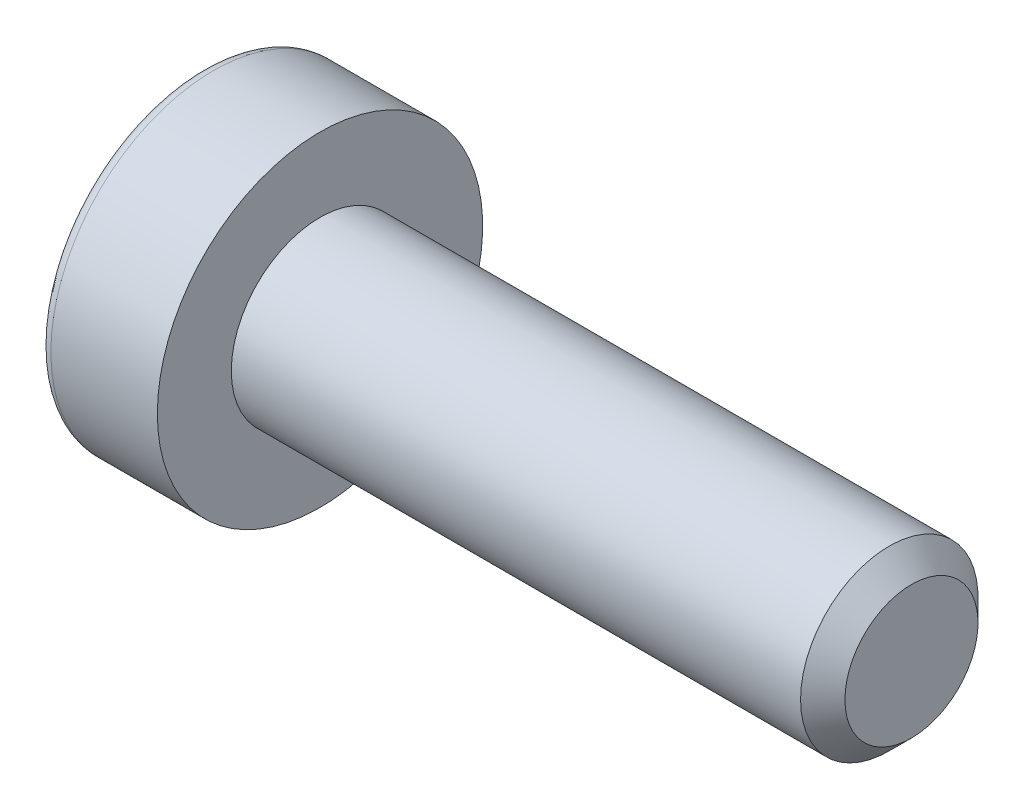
from build123d import *

# Parameters (mm, degrees)
CHANFREIN1_SIZE         = 0.375
ENL_V_MAT_EXTRU_1_DEPTH = 1
CONG_1_R                = 0.2


with BuildPart() as part:
    # Esquisse1 → R_volution1 (revolve)
    with BuildSketch(Plane.XY, mode=Mode.PRIVATE) as r_volution1_sk:
        Polygon((12, 0), (12, 1.5), (2, 1.5), (2, 2.75), (0, 2.75), (0, 0), align=None)
    revolve(r_volution1_sk.sketch.rotate(Axis((0, 0, 0), (1, 0, 0)), 90), axis=Axis((0, 0, 0), (1, 0, 0)))

    # Chanfrein1
    chanfrein1_edges = [part.edges().sort_by_distance(p)[0] for p in [
        (12, 0, -1.5),
    ]]
    chamfer(chanfrein1_edges, length=CHANFREIN1_SIZE)

    # Esquisse2 → R_volution2 (revolve)
    with BuildSketch(Plane.XY, mode=Mode.PRIVATE) as r_volution2_sk:
        Polygon((0, 0), (0, 1.25), (1, 1.25), (1.8, 0), align=None)
    revolve(r_volution2_sk.sketch.rotate(Axis((0, 0, 0), (1, 0, 0)), 90), axis=Axis((0, 0, 0), (1, 0, 0)))

    # Esquisse2_2 → Enl_vement de mati_re-R_volution1 (revolve, cut)
    with BuildSketch(Plane.XY, mode=Mode.PRIVATE) as enl_vement_de_mati_re_r_volution1_sk:
        Polygon((0, 0), (0, 1.25), (1, 1.25), (1.8, 0), align=None)
    revolve(enl_vement_de_mati_re_r_volution1_sk.sketch.rotate(Axis((0, 0, 0), (1, 0, 0)), 90), axis=Axis((0, 0, 0), (1, 0, 0)), mode=Mode.SUBTRACT)

    # Esquisse3 → Enl_v. mat.-Extru.1 (cut)
    with BuildSketch(Plane.ZY):
        Polygon((0, 1.443375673), (1.25, 0.721687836), (1.25, -0.721687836), (0, -1.443375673), (-1.25, -0.721687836), (-1.25, 0.721687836), align=None)
    extrude(amount=-ENL_V_MAT_EXTRU_1_DEPTH, mode=Mode.SUBTRACT)

    # Cong_1
    cong_1_edges = [part.edges().sort_by_distance(p)[0] for p in [
        (0, 0, -2.75),
    ]]
    fillet(cong_1_edges, radius=CONG_1_R)


solid = part.part
